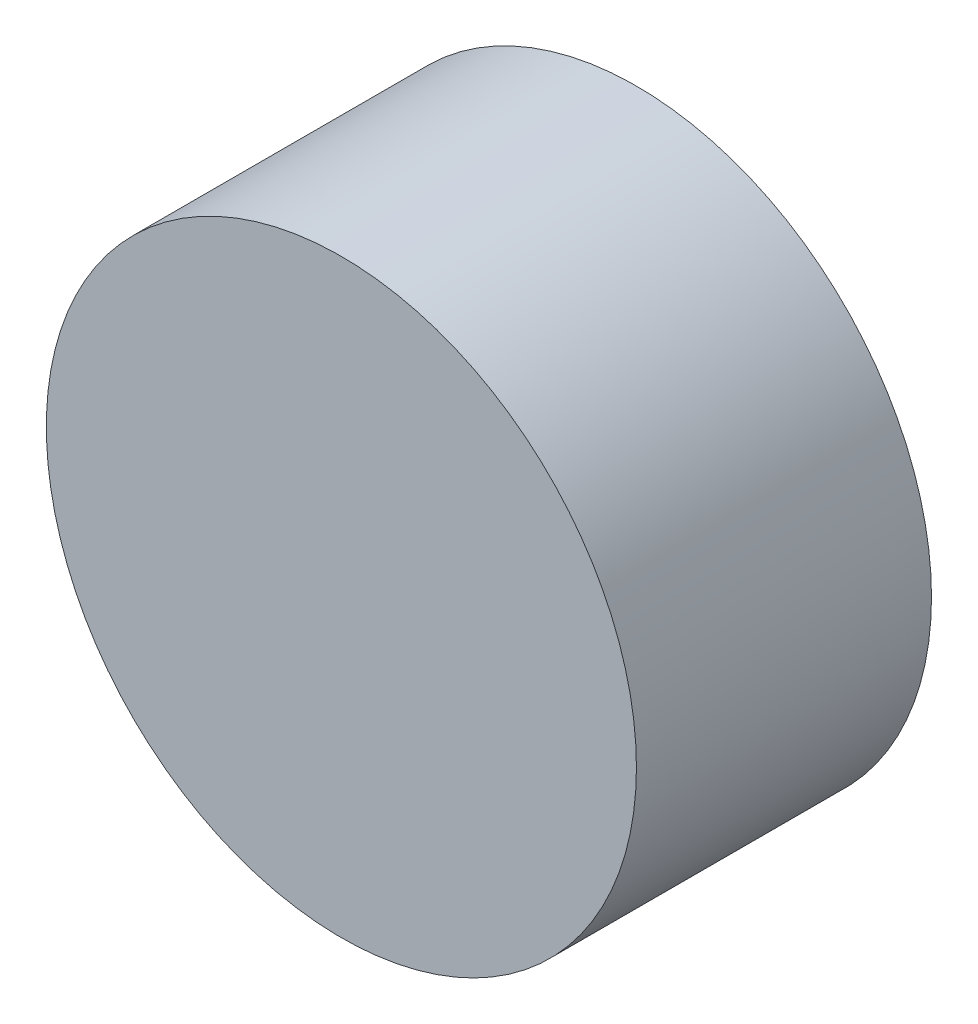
from build123d import *

# Parameters (mm, degrees)
SKETCH1_R      = 25.4
EXTRUDE1_DEPTH = 25.4


with BuildPart() as part:
    # Sketch1 → Extrude1 (new body)
    with BuildSketch(Plane.XY):
        Circle(SKETCH1_R)
    extrude(amount=EXTRUDE1_DEPTH)


solid = part.part
